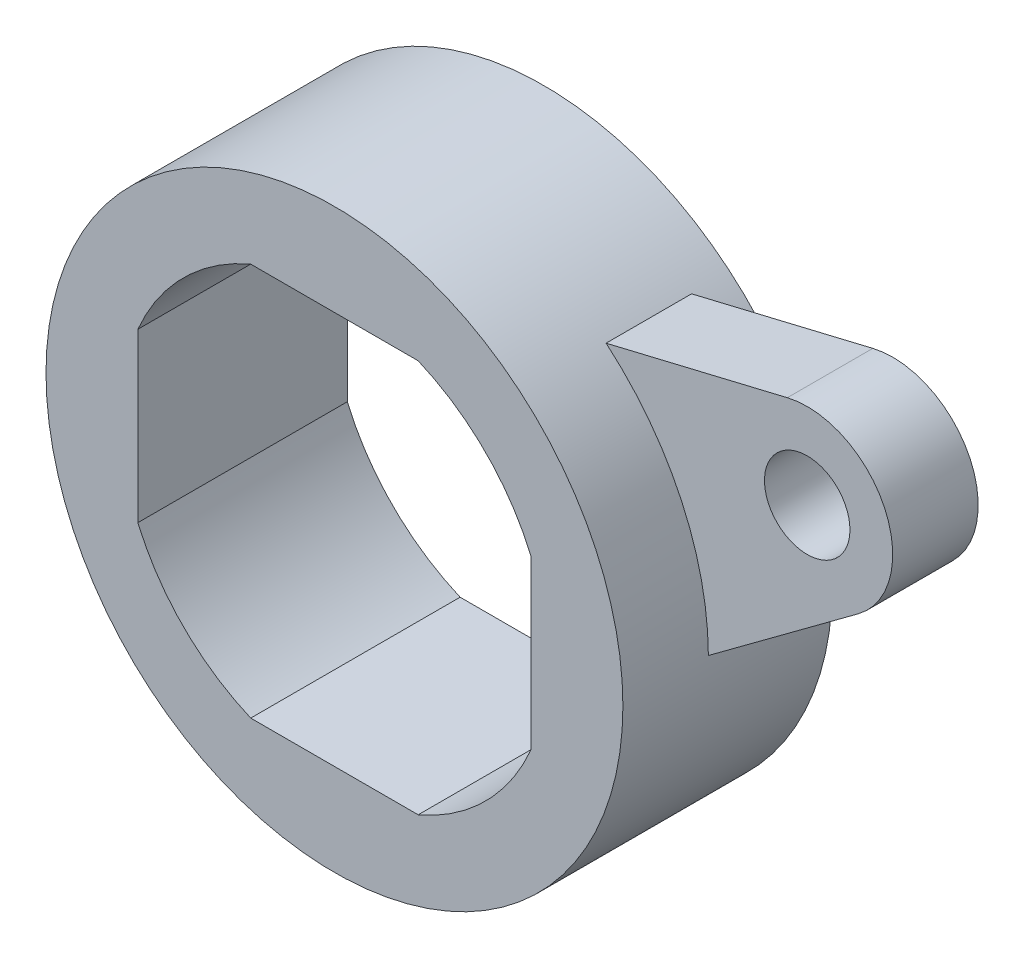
ISO-10303-21;
HEADER;
FILE_DESCRIPTION(('STEP AP214'),'2;1');
FILE_NAME('part.step','',(''),(''),'','','');
FILE_SCHEMA(('AUTOMOTIVE_DESIGN { 1 0 10303 214 1 1 1 1 }'));
ENDSEC;
DATA;
#1=APPLICATION_CONTEXT('core data for automotive mechanical design processes');
#2=APPLICATION_PROTOCOL_DEFINITION('international standard','automotive_design',2000,#1);
#3=PRODUCT_CONTEXT('',#1,'mechanical');
#4=PRODUCT('Part','Part','',(#3));
#5=PRODUCT_RELATED_PRODUCT_CATEGORY('part','',(#4));
#6=PRODUCT_DEFINITION_FORMATION('','',#4);
#7=PRODUCT_DEFINITION_CONTEXT('part definition',#1,'design');
#8=PRODUCT_DEFINITION('design','',#6,#7);
#9=PRODUCT_DEFINITION_SHAPE('','',#8);
#10=(LENGTH_UNIT() NAMED_UNIT(*) SI_UNIT(.MILLI.,.METRE.));
#11=(NAMED_UNIT(*) PLANE_ANGLE_UNIT() SI_UNIT($,.RADIAN.));
#12=(NAMED_UNIT(*) SI_UNIT($,.STERADIAN.) SOLID_ANGLE_UNIT());
#13=UNCERTAINTY_MEASURE_WITH_UNIT(LENGTH_MEASURE(1.E-05),#10,'distance_accuracy_value','');
#14=(GEOMETRIC_REPRESENTATION_CONTEXT(3) GLOBAL_UNCERTAINTY_ASSIGNED_CONTEXT((#13)) GLOBAL_UNIT_ASSIGNED_CONTEXT((#10,
#11,#12)) REPRESENTATION_CONTEXT('',''));
#15=CARTESIAN_POINT('',(0.,0.,0.));
#16=DIRECTION('',(0.,0.,1.));
#17=DIRECTION('',(1.,0.,0.));
#18=AXIS2_PLACEMENT_3D('',#15,#16,#17);
#19=CARTESIAN_POINT('',(0.,0.,27.));
#20=DIRECTION('',(0.,0.,1.));
#21=DIRECTION('',(1.,0.,0.));
#22=AXIS2_PLACEMENT_3D('',#19,#20,#21);
#23=PLANE('',#22);
#24=CARTESIAN_POINT('',(0.,0.,27.));
#25=DIRECTION('',(0.,0.,1.));
#26=DIRECTION('',(1.,0.,0.));
#27=AXIS2_PLACEMENT_3D('',#24,#25,#26);
#28=CIRCLE('',#27,6.75);
#29=CARTESIAN_POINT('',(6.75,0.,27.));
#30=VERTEX_POINT('',#29);
#31=EDGE_CURVE('E178',#30,#30,#28,.T.);
#32=ORIENTED_EDGE('',*,*,#31,.T.);
#33=EDGE_LOOP('',(#32));
#34=FACE_BOUND('',#33,.T.);
#35=CARTESIAN_POINT('',(0.,0.,27.));
#36=DIRECTION('',(0.,0.,1.));
#37=DIRECTION('',(1.,0.,0.));
#38=AXIS2_PLACEMENT_3D('',#35,#36,#37);
#39=CIRCLE('',#38,5.);
#40=CARTESIAN_POINT('',(4.6,1.95959179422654,27.));
#41=VERTEX_POINT('',#40);
#42=CARTESIAN_POINT('',(1.95959179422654,4.6,27.));
#43=VERTEX_POINT('',#42);
#44=EDGE_CURVE('E144',#41,#43,#39,.T.);
#45=ORIENTED_EDGE('',*,*,#44,.F.);
#46=DIRECTION('',(0.,-1.,0.));
#47=VECTOR('',#46,1.);
#48=CARTESIAN_POINT('',(4.6,0.,27.));
#49=LINE('',#48,#47);
#50=CARTESIAN_POINT('',(4.6,-1.95959179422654,27.));
#51=VERTEX_POINT('',#50);
#52=EDGE_CURVE('E129',#41,#51,#49,.T.);
#53=ORIENTED_EDGE('',*,*,#52,.T.);
#54=CARTESIAN_POINT('',(0.,0.,27.));
#55=DIRECTION('',(0.,0.,1.));
#56=DIRECTION('',(1.,0.,0.));
#57=AXIS2_PLACEMENT_3D('',#54,#55,#56);
#58=CIRCLE('',#57,5.);
#59=CARTESIAN_POINT('',(1.95959179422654,-4.6,27.));
#60=VERTEX_POINT('',#59);
#61=EDGE_CURVE('E137',#60,#51,#58,.T.);
#62=ORIENTED_EDGE('',*,*,#61,.F.);
#63=DIRECTION('',(-1.,0.,0.));
#64=VECTOR('',#63,1.);
#65=CARTESIAN_POINT('',(0.,-4.6,27.));
#66=LINE('',#65,#64);
#67=CARTESIAN_POINT('',(-1.95959179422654,-4.6,27.));
#68=VERTEX_POINT('',#67);
#69=EDGE_CURVE('E52',#60,#68,#66,.T.);
#70=ORIENTED_EDGE('',*,*,#69,.T.);
#71=CARTESIAN_POINT('',(0.,0.,27.));
#72=DIRECTION('',(0.,0.,1.));
#73=DIRECTION('',(1.,0.,0.));
#74=AXIS2_PLACEMENT_3D('',#71,#72,#73);
#75=CIRCLE('',#74,5.);
#76=CARTESIAN_POINT('',(-4.6,-1.95959179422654,27.));
#77=VERTEX_POINT('',#76);
#78=EDGE_CURVE('E158',#77,#68,#75,.T.);
#79=ORIENTED_EDGE('',*,*,#78,.F.);
#80=DIRECTION('',(0.,-1.,0.));
#81=VECTOR('',#80,1.);
#82=CARTESIAN_POINT('',(-4.6,0.,27.));
#83=LINE('',#82,#81);
#84=CARTESIAN_POINT('',(-4.6,1.95959179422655,27.));
#85=VERTEX_POINT('',#84);
#86=EDGE_CURVE('E155',#85,#77,#83,.T.);
#87=ORIENTED_EDGE('',*,*,#86,.F.);
#88=CARTESIAN_POINT('',(0.,0.,27.));
#89=DIRECTION('',(0.,0.,1.));
#90=DIRECTION('',(1.,0.,0.));
#91=AXIS2_PLACEMENT_3D('',#88,#89,#90);
#92=CIRCLE('',#91,5.);
#93=CARTESIAN_POINT('',(-1.95959179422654,4.6,27.));
#94=VERTEX_POINT('',#93);
#95=EDGE_CURVE('E152',#94,#85,#92,.T.);
#96=ORIENTED_EDGE('',*,*,#95,.F.);
#97=DIRECTION('',(-1.,0.,0.));
#98=VECTOR('',#97,1.);
#99=CARTESIAN_POINT('',(0.,4.6,27.));
#100=LINE('',#99,#98);
#101=EDGE_CURVE('E146',#43,#94,#100,.T.);
#102=ORIENTED_EDGE('',*,*,#101,.F.);
#103=EDGE_LOOP('',(#45,#53,#62,#70,#79,#87,#96,#102));
#104=FACE_BOUND('',#103,.T.);
#105=ADVANCED_FACE('F38',(#34,#104),#23,.T.);
#106=CARTESIAN_POINT('',(-11.07277942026,-15.,22.1));
#107=DIRECTION('',(0.,0.,1.));
#108=DIRECTION('',(1.,0.,0.));
#109=AXIS2_PLACEMENT_3D('',#106,#107,#108);
#110=PLANE('',#109);
#111=CARTESIAN_POINT('',(0.,0.,22.1));
#112=DIRECTION('',(0.,0.,1.));
#113=DIRECTION('',(1.,0.,0.));
#114=AXIS2_PLACEMENT_3D('',#111,#112,#113);
#115=CIRCLE('',#114,6.75);
#116=CARTESIAN_POINT('',(6.75,0.,22.1));
#117=VERTEX_POINT('',#116);
#118=EDGE_CURVE('E174',#117,#117,#115,.F.);
#119=ORIENTED_EDGE('',*,*,#118,.T.);
#120=EDGE_LOOP('',(#119));
#121=FACE_BOUND('',#120,.T.);
#122=DIRECTION('',(0.,1.,0.));
#123=VECTOR('',#122,1.);
#124=CARTESIAN_POINT('',(4.6,0.,22.1));
#125=LINE('',#124,#123);
#126=CARTESIAN_POINT('',(4.6,-1.95959179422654,22.1));
#127=VERTEX_POINT('',#126);
#128=CARTESIAN_POINT('',(4.6,1.95959179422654,22.1));
#129=VERTEX_POINT('',#128);
#130=EDGE_CURVE('E132',#127,#129,#125,.T.);
#131=ORIENTED_EDGE('',*,*,#130,.T.);
#132=CARTESIAN_POINT('',(0.,0.,22.1));
#133=DIRECTION('',(0.,0.,1.));
#134=DIRECTION('',(1.,0.,0.));
#135=AXIS2_PLACEMENT_3D('',#132,#133,#134);
#136=CIRCLE('',#135,5.);
#137=CARTESIAN_POINT('',(1.95959179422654,4.6,22.1));
#138=VERTEX_POINT('',#137);
#139=EDGE_CURVE('E269',#138,#129,#136,.F.);
#140=ORIENTED_EDGE('',*,*,#139,.F.);
#141=DIRECTION('',(1.,0.,0.));
#142=VECTOR('',#141,1.);
#143=CARTESIAN_POINT('',(0.,4.6,22.1));
#144=LINE('',#143,#142);
#145=CARTESIAN_POINT('',(-1.95959179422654,4.6,22.1));
#146=VERTEX_POINT('',#145);
#147=EDGE_CURVE('E272',#146,#138,#144,.T.);
#148=ORIENTED_EDGE('',*,*,#147,.F.);
#149=CARTESIAN_POINT('',(0.,0.,22.1));
#150=DIRECTION('',(0.,0.,1.));
#151=DIRECTION('',(1.,0.,0.));
#152=AXIS2_PLACEMENT_3D('',#149,#150,#151);
#153=CIRCLE('',#152,5.);
#154=CARTESIAN_POINT('',(-4.6,1.95959179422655,22.1));
#155=VERTEX_POINT('',#154);
#156=EDGE_CURVE('E276',#155,#146,#153,.F.);
#157=ORIENTED_EDGE('',*,*,#156,.F.);
#158=DIRECTION('',(0.,1.,0.));
#159=VECTOR('',#158,1.);
#160=CARTESIAN_POINT('',(-4.6,0.,22.1));
#161=LINE('',#160,#159);
#162=CARTESIAN_POINT('',(-4.6,-1.95959179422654,22.1));
#163=VERTEX_POINT('',#162);
#164=EDGE_CURVE('E278',#163,#155,#161,.T.);
#165=ORIENTED_EDGE('',*,*,#164,.F.);
#166=CARTESIAN_POINT('',(0.,0.,22.1));
#167=DIRECTION('',(0.,0.,1.));
#168=DIRECTION('',(1.,0.,0.));
#169=AXIS2_PLACEMENT_3D('',#166,#167,#168);
#170=CIRCLE('',#169,5.);
#171=CARTESIAN_POINT('',(-1.95959179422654,-4.6,22.1));
#172=VERTEX_POINT('',#171);
#173=EDGE_CURVE('E280',#172,#163,#170,.F.);
#174=ORIENTED_EDGE('',*,*,#173,.F.);
#175=DIRECTION('',(1.,0.,0.));
#176=VECTOR('',#175,1.);
#177=CARTESIAN_POINT('',(0.,-4.6,22.1));
#178=LINE('',#177,#176);
#179=CARTESIAN_POINT('',(1.95959179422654,-4.6,22.1));
#180=VERTEX_POINT('',#179);
#181=EDGE_CURVE('E282',#172,#180,#178,.T.);
#182=ORIENTED_EDGE('',*,*,#181,.T.);
#183=CARTESIAN_POINT('',(0.,0.,22.1));
#184=DIRECTION('',(0.,0.,1.));
#185=DIRECTION('',(1.,0.,0.));
#186=AXIS2_PLACEMENT_3D('',#183,#184,#185);
#187=CIRCLE('',#186,5.);
#188=EDGE_CURVE('E181',#127,#180,#187,.F.);
#189=ORIENTED_EDGE('',*,*,#188,.F.);
#190=EDGE_LOOP('',(#131,#140,#148,#157,#165,#174,#182,#189));
#191=FACE_BOUND('',#190,.T.);
#192=ADVANCED_FACE('F252',(#121,#191),#110,.F.);
#193=CARTESIAN_POINT('',(0.,0.,3.00811690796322));
#194=DIRECTION('',(0.,0.,1.));
#195=DIRECTION('',(1.,0.,0.));
#196=AXIS2_PLACEMENT_3D('',#193,#194,#195);
#197=CYLINDRICAL_SURFACE('',#196,6.75);
#198=ORIENTED_EDGE('',*,*,#31,.F.);
#199=EDGE_LOOP('',(#198));
#200=FACE_BOUND('',#199,.T.);
#201=ORIENTED_EDGE('',*,*,#118,.F.);
#202=EDGE_LOOP('',(#201));
#203=FACE_BOUND('',#202,.T.);
#204=CARTESIAN_POINT('',(0.,0.,23.));
#205=DIRECTION('',(0.,0.,1.));
#206=DIRECTION('',(1.,0.,0.));
#207=AXIS2_PLACEMENT_3D('',#204,#205,#206);
#208=CIRCLE('',#207,6.75);
#209=CARTESIAN_POINT('',(6.74996060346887,0.0230619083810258,23.));
#210=VERTEX_POINT('',#209);
#211=CARTESIAN_POINT('',(4.35645748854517,5.15594590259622,23.));
#212=VERTEX_POINT('',#211);
#213=EDGE_CURVE('E186',#210,#212,#208,.T.);
#214=ORIENTED_EDGE('',*,*,#213,.F.);
#215=DIRECTION('',(0.,0.,1.));
#216=VECTOR('',#215,1.);
#217=CARTESIAN_POINT('',(6.74996060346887,0.0230619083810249,3.00811690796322));
#218=LINE('',#217,#216);
#219=CARTESIAN_POINT('',(6.74996060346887,0.0230619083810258,25.));
#220=VERTEX_POINT('',#219);
#221=EDGE_CURVE('E177',#220,#210,#218,.F.);
#222=ORIENTED_EDGE('',*,*,#221,.F.);
#223=CARTESIAN_POINT('',(0.,0.,25.));
#224=DIRECTION('',(0.,0.,1.));
#225=DIRECTION('',(1.,0.,0.));
#226=AXIS2_PLACEMENT_3D('',#223,#224,#225);
#227=CIRCLE('',#226,6.75);
#228=CARTESIAN_POINT('',(4.35645748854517,5.15594590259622,25.));
#229=VERTEX_POINT('',#228);
#230=EDGE_CURVE('E11',#220,#229,#227,.T.);
#231=ORIENTED_EDGE('',*,*,#230,.T.);
#232=DIRECTION('',(0.,0.,1.));
#233=VECTOR('',#232,1.);
#234=CARTESIAN_POINT('',(4.35645748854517,5.15594590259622,3.00811690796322));
#235=LINE('',#234,#233);
#236=EDGE_CURVE('E183',#229,#212,#235,.F.);
#237=ORIENTED_EDGE('',*,*,#236,.T.);
#238=EDGE_LOOP('',(#214,#222,#231,#237));
#239=FACE_BOUND('',#238,.T.);
#240=ADVANCED_FACE('F231',(#200,#203,#239),#197,.T.);
#241=CARTESIAN_POINT('',(9.06307787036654,4.22618261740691,23.));
#242=DIRECTION('',(0.,0.,1.));
#243=DIRECTION('',(1.,0.,0.));
#244=AXIS2_PLACEMENT_3D('',#241,#242,#243);
#245=CYLINDRICAL_SURFACE('',#244,1.);
#246=CARTESIAN_POINT('',(9.06307787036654,4.22618261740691,23.));
#247=DIRECTION('',(0.,0.,1.));
#248=DIRECTION('',(1.,0.,0.));
#249=AXIS2_PLACEMENT_3D('',#246,#247,#248);
#250=CIRCLE('',#249,1.);
#251=CARTESIAN_POINT('',(10.0630778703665,4.22618261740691,23.));
#252=VERTEX_POINT('',#251);
#253=EDGE_CURVE('E199',#252,#252,#250,.T.);
#254=ORIENTED_EDGE('',*,*,#253,.F.);
#255=EDGE_LOOP('',(#254));
#256=FACE_BOUND('',#255,.T.);
#257=CARTESIAN_POINT('',(9.06307787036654,4.22618261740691,25.));
#258=DIRECTION('',(0.,0.,1.));
#259=DIRECTION('',(1.,0.,0.));
#260=AXIS2_PLACEMENT_3D('',#257,#258,#259);
#261=CIRCLE('',#260,1.);
#262=CARTESIAN_POINT('',(10.0630778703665,4.22618261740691,25.));
#263=VERTEX_POINT('',#262);
#264=EDGE_CURVE('E193',#263,#263,#261,.T.);
#265=ORIENTED_EDGE('',*,*,#264,.T.);
#266=EDGE_LOOP('',(#265));
#267=FACE_BOUND('',#266,.T.);
#268=ADVANCED_FACE('F239',(#256,#267),#245,.F.);
#269=CARTESIAN_POINT('',(9.06307787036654,4.22618261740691,23.));
#270=DIRECTION('',(0.,0.,1.));
#271=DIRECTION('',(1.,0.,0.));
#272=AXIS2_PLACEMENT_3D('',#269,#270,#271);
#273=CYLINDRICAL_SURFACE('',#272,2.);
#274=CARTESIAN_POINT('',(9.06307787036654,4.22618261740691,25.));
#275=DIRECTION('',(0.,0.,1.));
#276=DIRECTION('',(1.,0.,0.));
#277=AXIS2_PLACEMENT_3D('',#274,#275,#276);
#278=CIRCLE('',#277,2.);
#279=CARTESIAN_POINT('',(10.2537602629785,2.61923661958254,25.));
#280=VERTEX_POINT('',#279);
#281=CARTESIAN_POINT('',(8.59744170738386,6.17122322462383,25.));
#282=VERTEX_POINT('',#281);
#283=EDGE_CURVE('E205',#280,#282,#278,.T.);
#284=ORIENTED_EDGE('',*,*,#283,.F.);
#285=DIRECTION('',(0.,0.,1.));
#286=VECTOR('',#285,1.);
#287=CARTESIAN_POINT('',(10.2537602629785,2.61923661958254,23.));
#288=LINE('',#287,#286);
#289=CARTESIAN_POINT('',(10.2537602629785,2.61923661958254,23.));
#290=VERTEX_POINT('',#289);
#291=EDGE_CURVE('E202',#290,#280,#288,.T.);
#292=ORIENTED_EDGE('',*,*,#291,.F.);
#293=CARTESIAN_POINT('',(9.06307787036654,4.22618261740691,23.));
#294=DIRECTION('',(0.,0.,1.));
#295=DIRECTION('',(1.,0.,0.));
#296=AXIS2_PLACEMENT_3D('',#293,#294,#295);
#297=CIRCLE('',#296,2.);
#298=CARTESIAN_POINT('',(8.59744170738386,6.17122322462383,23.));
#299=VERTEX_POINT('',#298);
#300=EDGE_CURVE('E192',#290,#299,#297,.T.);
#301=ORIENTED_EDGE('',*,*,#300,.T.);
#302=DIRECTION('',(0.,0.,1.));
#303=VECTOR('',#302,1.);
#304=CARTESIAN_POINT('',(8.59744170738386,6.17122322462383,23.));
#305=LINE('',#304,#303);
#306=EDGE_CURVE('E45',#299,#282,#305,.T.);
#307=ORIENTED_EDGE('',*,*,#306,.T.);
#308=EDGE_LOOP('',(#284,#292,#301,#307));
#309=FACE_BOUND('',#308,.T.);
#310=ADVANCED_FACE('F224',(#309),#273,.T.);
#311=CARTESIAN_POINT('',(0.,0.,23.));
#312=DIRECTION('',(0.,0.,1.));
#313=DIRECTION('',(1.,0.,0.));
#314=AXIS2_PLACEMENT_3D('',#311,#312,#313);
#315=PLANE('',#314);
#316=DIRECTION('',(-0.803472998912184,-0.595341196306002,0.));
#317=VECTOR('',#316,1.);
#318=CARTESIAN_POINT('',(2.38136478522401,-3.21389199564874,23.));
#319=LINE('',#318,#317);
#320=EDGE_CURVE('E189',#290,#210,#319,.T.);
#321=ORIENTED_EDGE('',*,*,#320,.T.);
#322=ORIENTED_EDGE('',*,*,#213,.T.);
#323=DIRECTION('',(-0.97252030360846,-0.23281808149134,0.));
#324=VECTOR('',#323,1.);
#325=CARTESIAN_POINT('',(-0.931272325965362,3.89008121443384,23.));
#326=LINE('',#325,#324);
#327=EDGE_CURVE('E196',#299,#212,#326,.T.);
#328=ORIENTED_EDGE('',*,*,#327,.F.);
#329=ORIENTED_EDGE('',*,*,#300,.F.);
#330=EDGE_LOOP('',(#321,#322,#328,#329));
#331=FACE_BOUND('',#330,.T.);
#332=ORIENTED_EDGE('',*,*,#253,.T.);
#333=EDGE_LOOP('',(#332));
#334=FACE_BOUND('',#333,.T.);
#335=ADVANCED_FACE('F233',(#331,#334),#315,.F.);
#336=CARTESIAN_POINT('',(0.,0.,25.));
#337=DIRECTION('',(0.,0.,1.));
#338=DIRECTION('',(1.,0.,0.));
#339=AXIS2_PLACEMENT_3D('',#336,#337,#338);
#340=PLANE('',#339);
#341=ORIENTED_EDGE('',*,*,#230,.F.);
#342=DIRECTION('',(-0.803472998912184,-0.595341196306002,0.));
#343=VECTOR('',#342,1.);
#344=CARTESIAN_POINT('',(2.38136478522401,-3.21389199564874,25.));
#345=LINE('',#344,#343);
#346=EDGE_CURVE('E188',#280,#220,#345,.T.);
#347=ORIENTED_EDGE('',*,*,#346,.F.);
#348=ORIENTED_EDGE('',*,*,#283,.T.);
#349=DIRECTION('',(-0.97252030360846,-0.23281808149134,0.));
#350=VECTOR('',#349,1.);
#351=CARTESIAN_POINT('',(-0.931272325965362,3.89008121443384,25.));
#352=LINE('',#351,#350);
#353=EDGE_CURVE('E208',#282,#229,#352,.T.);
#354=ORIENTED_EDGE('',*,*,#353,.T.);
#355=EDGE_LOOP('',(#341,#347,#348,#354));
#356=FACE_BOUND('',#355,.T.);
#357=ORIENTED_EDGE('',*,*,#264,.F.);
#358=EDGE_LOOP('',(#357));
#359=FACE_BOUND('',#358,.T.);
#360=ADVANCED_FACE('F221',(#356,#359),#340,.T.);
#361=CARTESIAN_POINT('',(2.38136478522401,-3.21389199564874,23.));
#362=DIRECTION('',(-0.595341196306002,0.803472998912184,0.));
#363=DIRECTION('',(-0.803472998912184,-0.595341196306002,0.));
#364=AXIS2_PLACEMENT_3D('',#361,#362,#363);
#365=PLANE('',#364);
#366=ORIENTED_EDGE('',*,*,#346,.T.);
#367=ORIENTED_EDGE('',*,*,#221,.T.);
#368=ORIENTED_EDGE('',*,*,#320,.F.);
#369=ORIENTED_EDGE('',*,*,#291,.T.);
#370=EDGE_LOOP('',(#366,#367,#368,#369));
#371=FACE_BOUND('',#370,.T.);
#372=ADVANCED_FACE('F215',(#371),#365,.F.);
#373=CARTESIAN_POINT('',(-0.931272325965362,3.89008121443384,23.));
#374=DIRECTION('',(-0.23281808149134,0.97252030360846,0.));
#375=DIRECTION('',(-0.97252030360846,-0.23281808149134,0.));
#376=AXIS2_PLACEMENT_3D('',#373,#374,#375);
#377=PLANE('',#376);
#378=ORIENTED_EDGE('',*,*,#236,.F.);
#379=ORIENTED_EDGE('',*,*,#353,.F.);
#380=ORIENTED_EDGE('',*,*,#306,.F.);
#381=ORIENTED_EDGE('',*,*,#327,.T.);
#382=EDGE_LOOP('',(#378,#379,#380,#381));
#383=FACE_BOUND('',#382,.T.);
#384=ADVANCED_FACE('F228',(#383),#377,.T.);
#385=CARTESIAN_POINT('',(4.6,0.,9.08923522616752));
#386=DIRECTION('',(-1.,0.,0.));
#387=DIRECTION('',(0.,0.,1.));
#388=AXIS2_PLACEMENT_3D('',#385,#386,#387);
#389=PLANE('',#388);
#390=DIRECTION('',(0.,0.,1.));
#391=VECTOR('',#390,1.);
#392=CARTESIAN_POINT('',(4.6,-1.95959179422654,9.08923522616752));
#393=LINE('',#392,#391);
#394=EDGE_CURVE('E60',#127,#51,#393,.T.);
#395=ORIENTED_EDGE('',*,*,#394,.T.);
#396=ORIENTED_EDGE('',*,*,#52,.F.);
#397=DIRECTION('',(0.,0.,1.));
#398=VECTOR('',#397,1.);
#399=CARTESIAN_POINT('',(4.6,1.95959179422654,9.08923522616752));
#400=LINE('',#399,#398);
#401=EDGE_CURVE('E134',#129,#41,#400,.T.);
#402=ORIENTED_EDGE('',*,*,#401,.F.);
#403=ORIENTED_EDGE('',*,*,#130,.F.);
#404=EDGE_LOOP('',(#395,#396,#402,#403));
#405=FACE_BOUND('',#404,.T.);
#406=ADVANCED_FACE('F126',(#405),#389,.T.);
#407=CARTESIAN_POINT('',(0.,0.,9.08923522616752));
#408=DIRECTION('',(0.,0.,1.));
#409=DIRECTION('',(1.,0.,0.));
#410=AXIS2_PLACEMENT_3D('',#407,#408,#409);
#411=CYLINDRICAL_SURFACE('',#410,5.);
#412=ORIENTED_EDGE('',*,*,#139,.T.);
#413=ORIENTED_EDGE('',*,*,#401,.T.);
#414=ORIENTED_EDGE('',*,*,#44,.T.);
#415=DIRECTION('',(0.,0.,1.));
#416=VECTOR('',#415,1.);
#417=CARTESIAN_POINT('',(1.95959179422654,4.6,9.08923522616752));
#418=LINE('',#417,#416);
#419=EDGE_CURVE('E171',#138,#43,#418,.T.);
#420=ORIENTED_EDGE('',*,*,#419,.F.);
#421=EDGE_LOOP('',(#412,#413,#414,#420));
#422=FACE_BOUND('',#421,.T.);
#423=ADVANCED_FACE('F304',(#422),#411,.F.);
#424=CARTESIAN_POINT('',(0.,4.6,9.08923522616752));
#425=DIRECTION('',(0.,1.,0.));
#426=DIRECTION('',(0.,0.,1.));
#427=AXIS2_PLACEMENT_3D('',#424,#425,#426);
#428=PLANE('',#427);
#429=ORIENTED_EDGE('',*,*,#147,.T.);
#430=ORIENTED_EDGE('',*,*,#419,.T.);
#431=ORIENTED_EDGE('',*,*,#101,.T.);
#432=DIRECTION('',(0.,0.,1.));
#433=VECTOR('',#432,1.);
#434=CARTESIAN_POINT('',(-1.95959179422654,4.6,9.08923522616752));
#435=LINE('',#434,#433);
#436=EDGE_CURVE('E169',#146,#94,#435,.T.);
#437=ORIENTED_EDGE('',*,*,#436,.F.);
#438=EDGE_LOOP('',(#429,#430,#431,#437));
#439=FACE_BOUND('',#438,.T.);
#440=ADVANCED_FACE('F301',(#439),#428,.F.);
#441=CARTESIAN_POINT('',(0.,0.,9.08923522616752));
#442=DIRECTION('',(0.,0.,1.));
#443=DIRECTION('',(1.,0.,0.));
#444=AXIS2_PLACEMENT_3D('',#441,#442,#443);
#445=CYLINDRICAL_SURFACE('',#444,5.);
#446=ORIENTED_EDGE('',*,*,#156,.T.);
#447=ORIENTED_EDGE('',*,*,#436,.T.);
#448=ORIENTED_EDGE('',*,*,#95,.T.);
#449=DIRECTION('',(0.,0.,1.));
#450=VECTOR('',#449,1.);
#451=CARTESIAN_POINT('',(-4.6,1.95959179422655,9.08923522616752));
#452=LINE('',#451,#450);
#453=EDGE_CURVE('E167',#155,#85,#452,.T.);
#454=ORIENTED_EDGE('',*,*,#453,.F.);
#455=EDGE_LOOP('',(#446,#447,#448,#454));
#456=FACE_BOUND('',#455,.T.);
#457=ADVANCED_FACE('F298',(#456),#445,.F.);
#458=CARTESIAN_POINT('',(-4.6,0.,9.08923522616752));
#459=DIRECTION('',(-1.,0.,0.));
#460=DIRECTION('',(0.,0.,1.));
#461=AXIS2_PLACEMENT_3D('',#458,#459,#460);
#462=PLANE('',#461);
#463=ORIENTED_EDGE('',*,*,#164,.T.);
#464=ORIENTED_EDGE('',*,*,#453,.T.);
#465=ORIENTED_EDGE('',*,*,#86,.T.);
#466=DIRECTION('',(0.,0.,1.));
#467=VECTOR('',#466,1.);
#468=CARTESIAN_POINT('',(-4.6,-1.95959179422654,9.08923522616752));
#469=LINE('',#468,#467);
#470=EDGE_CURVE('E165',#163,#77,#469,.T.);
#471=ORIENTED_EDGE('',*,*,#470,.F.);
#472=EDGE_LOOP('',(#463,#464,#465,#471));
#473=FACE_BOUND('',#472,.T.);
#474=ADVANCED_FACE('F292',(#473),#462,.F.);
#475=CARTESIAN_POINT('',(0.,0.,9.08923522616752));
#476=DIRECTION('',(0.,0.,1.));
#477=DIRECTION('',(1.,0.,0.));
#478=AXIS2_PLACEMENT_3D('',#475,#476,#477);
#479=CYLINDRICAL_SURFACE('',#478,5.);
#480=ORIENTED_EDGE('',*,*,#173,.T.);
#481=ORIENTED_EDGE('',*,*,#470,.T.);
#482=ORIENTED_EDGE('',*,*,#78,.T.);
#483=DIRECTION('',(0.,0.,1.));
#484=VECTOR('',#483,1.);
#485=CARTESIAN_POINT('',(-1.95959179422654,-4.6,9.08923522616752));
#486=LINE('',#485,#484);
#487=EDGE_CURVE('E163',#172,#68,#486,.T.);
#488=ORIENTED_EDGE('',*,*,#487,.F.);
#489=EDGE_LOOP('',(#480,#481,#482,#488));
#490=FACE_BOUND('',#489,.T.);
#491=ADVANCED_FACE('F290',(#490),#479,.F.);
#492=CARTESIAN_POINT('',(0.,-4.6,9.08923522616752));
#493=DIRECTION('',(0.,1.,0.));
#494=DIRECTION('',(0.,0.,1.));
#495=AXIS2_PLACEMENT_3D('',#492,#493,#494);
#496=PLANE('',#495);
#497=ORIENTED_EDGE('',*,*,#487,.T.);
#498=ORIENTED_EDGE('',*,*,#69,.F.);
#499=DIRECTION('',(0.,0.,1.));
#500=VECTOR('',#499,1.);
#501=CARTESIAN_POINT('',(1.95959179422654,-4.6,9.08923522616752));
#502=LINE('',#501,#500);
#503=EDGE_CURVE('E139',#180,#60,#502,.T.);
#504=ORIENTED_EDGE('',*,*,#503,.F.);
#505=ORIENTED_EDGE('',*,*,#181,.F.);
#506=EDGE_LOOP('',(#497,#498,#504,#505));
#507=FACE_BOUND('',#506,.T.);
#508=ADVANCED_FACE('F283',(#507),#496,.T.);
#509=CARTESIAN_POINT('',(0.,0.,9.08923522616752));
#510=DIRECTION('',(0.,0.,1.));
#511=DIRECTION('',(1.,0.,0.));
#512=AXIS2_PLACEMENT_3D('',#509,#510,#511);
#513=CYLINDRICAL_SURFACE('',#512,5.);
#514=ORIENTED_EDGE('',*,*,#188,.T.);
#515=ORIENTED_EDGE('',*,*,#503,.T.);
#516=ORIENTED_EDGE('',*,*,#61,.T.);
#517=ORIENTED_EDGE('',*,*,#394,.F.);
#518=EDGE_LOOP('',(#514,#515,#516,#517));
#519=FACE_BOUND('',#518,.T.);
#520=ADVANCED_FACE('F138',(#519),#513,.F.);
#521=CLOSED_SHELL('',(#105,#192,#240,#268,#310,#335,#360,#372,#384,#406,#423,#440,#457,#474,
#491,#508,#520));
#522=MANIFOLD_SOLID_BREP('B2',#521);
#523=ADVANCED_BREP_SHAPE_REPRESENTATION('',(#18,#522),#14);
#524=SHAPE_DEFINITION_REPRESENTATION(#9,#523);
ENDSEC;
END-ISO-10303-21;
